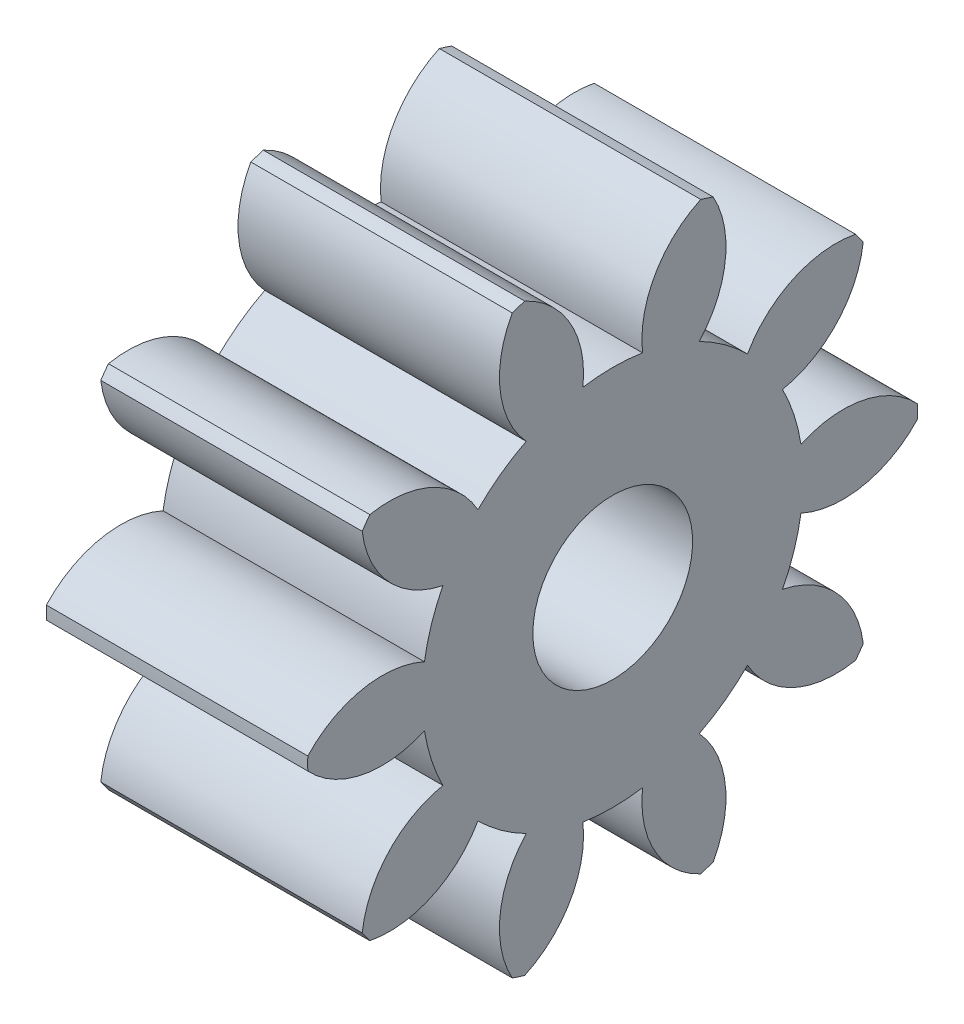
from build123d import *

# Parameters (mm, degrees)
BASPROSKE_W     = 18
BASPROSKE_H     = 21
TOOTHCUT_DEPTH  = 35.727510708
TEETHCUTS_COUNT = 10
TEETHCUTS_ANGLE = 324
BORSKE_R        = 5.5
BORE_DEPTH      = 50.0000508


with BuildPart() as part:
    # BasProSke → Base-Revolve (revolve)
    with BuildSketch(Plane(origin=(0, 0, 0), x_dir=(1, 0, 0), z_dir=(0, 1, 0)), mode=Mode.PRIVATE) as base_revolve_sk:
        with Locations((9, 10.5)):
            Rectangle(BASPROSKE_W, BASPROSKE_H)
    revolve(base_revolve_sk.sketch.rotate(Axis((-10, 0, 0), (1, 0, 0)), 180), axis=Axis((-10, 0, 0), (1, 0, 0)))

    # TooCutSke → ToothCut (cut, through all)
    with BuildSketch(Plane(origin=(0, 0, 0), x_dir=(0, 0, -1), z_dir=(1, 0, 0))):
        with BuildLine():
            ThreePointArc((2.053493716, 12.96235085), (0, 13.124), (-2.053493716, 12.96235085))
            ThreePointArc((-2.053493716, 12.96235085), (-2.911994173, 17.198355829), (-6.094590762, 20.122708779))
            ThreePointArc((-6.094590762, 20.122708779), (0, 21.0254), (6.094590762, 20.122708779))
            ThreePointArc((6.094590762, 20.122708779), (2.911994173, 17.198355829), (2.053493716, 12.96235085))
        make_face()
    toothcut = extrude(amount=TOOTHCUT_DEPTH, mode=Mode.SUBTRACT)

    # TeethCuts: ToothCut ×10 about axis
    teethcuts_axis = Axis((-10, 0, 0), (1, 0, 0))
    for i in range(1, TEETHCUTS_COUNT):
        add(toothcut.rotate(teethcuts_axis, i * TEETHCUTS_ANGLE / (TEETHCUTS_COUNT - 1)), mode=Mode.SUBTRACT)

    # BorSke → Bore (cut, symmetric)
    with BuildSketch(Plane(origin=(0, 0, 0), x_dir=(0, 0, -1), z_dir=(1, 0, 0))):
        with Locations(Location((0, 0, 0), (0, 0, 180))):
            Circle(BORSKE_R)
    extrude(amount=BORE_DEPTH, both=True, mode=Mode.SUBTRACT)


solid = part.part
